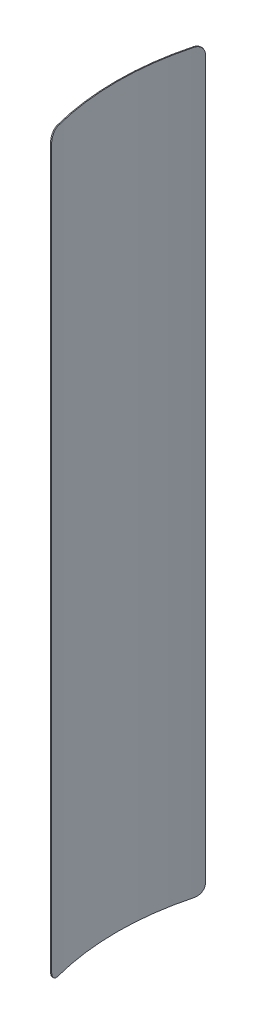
from build123d import *

# Parameters (mm, degrees)
BOSS_EXTRUDE1_DEPTH = 127
FILLET1_R           = 3.175


with BuildPart() as part:
    # Sketch1 → Boss-Extrude1 (new, symmetric)
    with BuildSketch(Plane(origin=(0, 0, 0), x_dir=(1, 0, 0), z_dir=(0, 1, 0))):
        with BuildLine():
            Line((-87.778234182, 26.513983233), (-88.070013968, 26.602117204))
            ThreePointArc((-88.070013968, 26.602117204), (-92, 0), (-88.070013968, -26.602117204))
            Line((-88.070013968, -26.602117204), (-87.778234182, -26.513983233))
            ThreePointArc((-87.778234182, -26.513983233), (-91.6952, 0), (-87.778234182, 26.513983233))
        make_face()
    extrude(amount=BOSS_EXTRUDE1_DEPTH, both=True)

    # Fillet1
    fillet1_edges = [part.edges().sort_by_distance(p)[0] for p in [
        (-87.924124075, -127, 26.558050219),
        (-87.924124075, 127, 26.558050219),
        (-87.924124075, 127, -26.558050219),
        (-87.924124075, -127, -26.558050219),
    ]]
    fillet(fillet1_edges, radius=FILLET1_R)


solid = part.part
